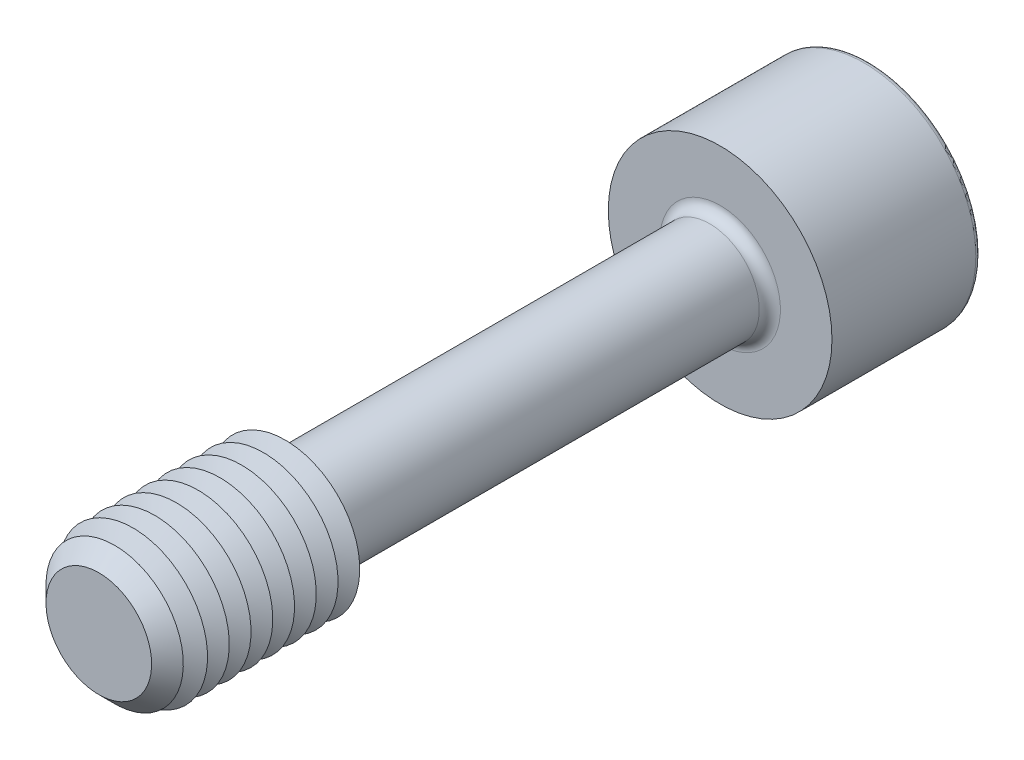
from build123d import *

# Parameters (mm, degrees)
SKETCH1_R       = 4
EXTRUDE1_DEPTH  = 25
CHAMFER1_SIZE   = 1.75
SKETCH3_R       = 9
EXTRUDE2_DEPTH  = 12
EXTRUDE3_DEPTH  = 10
FILLET1_R       = 0.85
FILLET2_R       = 0.425
LPATTERN1_COUNT = 8
LPATTERN1_PITCH = 1.75


with BuildPart() as part:
    # Sketch1 → Extrude1 (new, symmetric)
    with BuildSketch(Plane.XY):
        Circle(SKETCH1_R)
    extrude(amount=EXTRUDE1_DEPTH, both=True)

    # Sketch2 → Revolve1 (revolve)
    with BuildSketch(Plane(origin=(0, 0, 0), x_dir=(0, 0, -1), z_dir=(1, 0, 0))):
        Polygon((-25, 0), (-25, 6), (-10, 6), (-8.845299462, 4), (-8.845299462, 0), align=None)
    revolve(axis=Axis((0, 0, 8.845299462), (0, 0, 1)))

    # Chamfer1
    chamfer1_edges = [part.edges().sort_by_distance(p)[0] for p in [
        (0, -6, 25),
    ]]
    chamfer(chamfer1_edges, length=CHAMFER1_SIZE)

    # Sketch3 → Extrude2 (add)
    with BuildSketch(Plane(origin=(0, 0, -25), x_dir=(-1, 0, 0), z_dir=(0, 0, -1))):
        Circle(SKETCH3_R)
    extrude(amount=EXTRUDE2_DEPTH)

    # Sketch4 → Extrude3 (cut)
    with BuildSketch(Plane(origin=(-13.7, 0, -37), x_dir=(1, 0, 0), z_dir=(0, 0, 1))):
        Polygon((10.813248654, -5), (16.586751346, -5), (19.473502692, 0), (16.586751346, 5), (10.813248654, 5), (7.926497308, 0), align=None)
    extrude(amount=EXTRUDE3_DEPTH, mode=Mode.SUBTRACT)

    # Fillet1
    fillet1_edges = [part.edges().sort_by_distance(p)[0] for p in [
        (-4, 0, -25),
    ]]
    fillet(fillet1_edges, radius=FILLET1_R)

    # Fillet2
    fillet2_edges = [part.edges().sort_by_distance(p)[0] for p in [
        (9, 0, -37),
    ]]
    fillet(fillet2_edges, radius=FILLET2_R)

    # Sketch5 → Cut-Revolve1 (revolve, cut)
    with BuildSketch(Plane(origin=(0, 0, 0), x_dir=(0, 0, -1), z_dir=(1, 0, 0)), mode=Mode.PRIVATE) as cut_revolve1_sk:
        Polygon((27, 0), (27, -5), (24.113248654, 0), align=None)
    revolve(cut_revolve1_sk.sketch.rotate(Axis((0, 0, -24.113248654), (0, 0, -1)), 90), axis=Axis((0, 0, -24.113248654), (0, 0, -1)), mode=Mode.SUBTRACT)

    # Sketch7 → Cut-Revolve2 (revolve, cut)
    with BuildSketch(Plane(origin=(0, 0, 0), x_dir=(0, 0, -1), z_dir=(1, 0, 0)), mode=Mode.PRIVATE) as cut_revolve2_sk:
        Polygon((-10, 6), (-10.875, 4.484455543), (-11.75, 6), align=None)
    cut_revolve2 = revolve(cut_revolve2_sk.sketch.rotate(Axis((0, 0, -1.332048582), (0, 0, 1)), 90), axis=Axis((0, 0, -1.332048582), (0, 0, 1)), mode=Mode.SUBTRACT)

    # LPattern1: Cut-Revolve2 ×8
    with Locations(*[(0, 0, i * LPATTERN1_PITCH) for i in range(1, LPATTERN1_COUNT)]):
        add(cut_revolve2, mode=Mode.SUBTRACT)


solid = part.part
